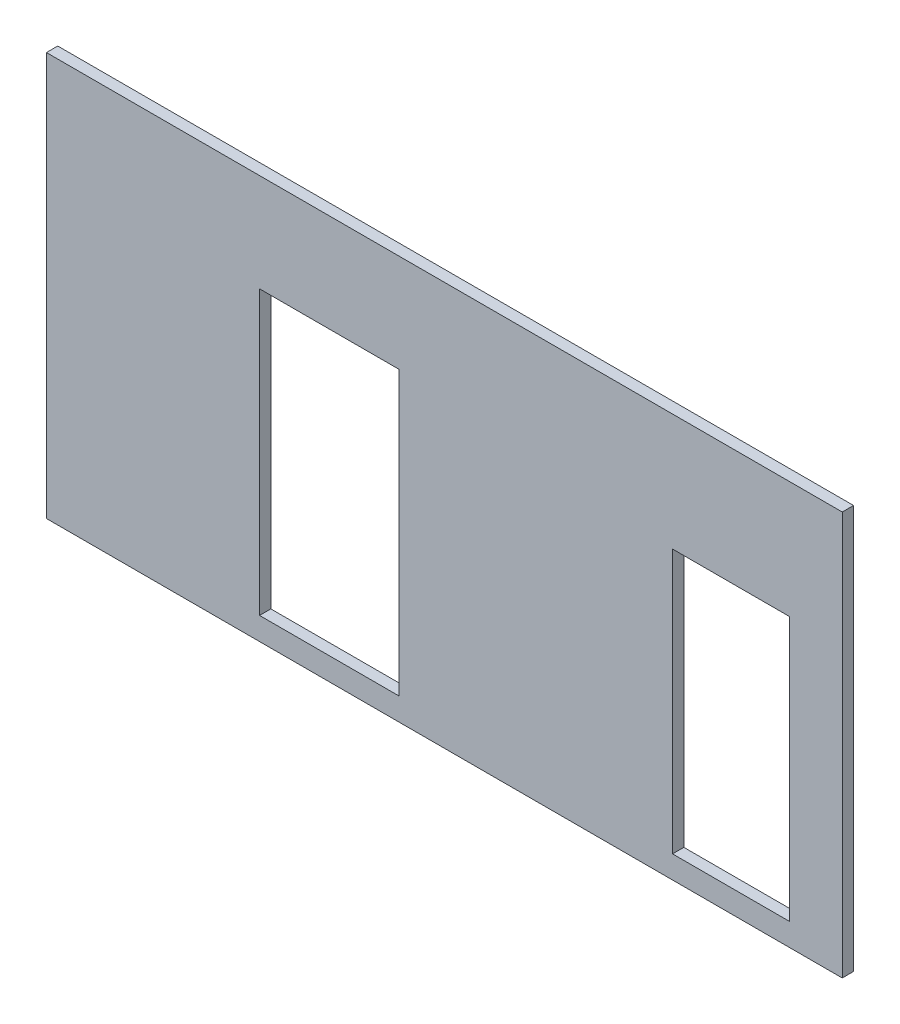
from build123d import *

# Parameters (mm, degrees)
ESQUISSE1_W             = 211
ESQUISSE1_H             = 107
EXTRUSION1_DEPTH        = 3
ESQUISSE2_W             = 37
ESQUISSE2_H             = 75
ESQUISSE2_W_2           = 31
ESQUISSE2_H_2           = 70
ENL_V_MAT_EXTRU_1_DEPTH = 3


with BuildPart() as part:
    # Esquisse1 → Extrusion1 (new body)
    with BuildSketch(Plane.XY):
        with Locations((105.5, 53.5)):
            Rectangle(ESQUISSE1_W, ESQUISSE1_H)
    extrude(amount=EXTRUSION1_DEPTH)

    # Esquisse2 → Enl_v. mat.-Extru.1 (cut)
    with BuildSketch(Plane.XY.offset(3)):
        with Locations((75, 43.5)):
            Rectangle(ESQUISSE2_W, ESQUISSE2_H)
        with Locations((181.5, 41)):
            Rectangle(ESQUISSE2_W_2, ESQUISSE2_H_2)
    extrude(amount=-ENL_V_MAT_EXTRU_1_DEPTH, mode=Mode.SUBTRACT)


solid = part.part
